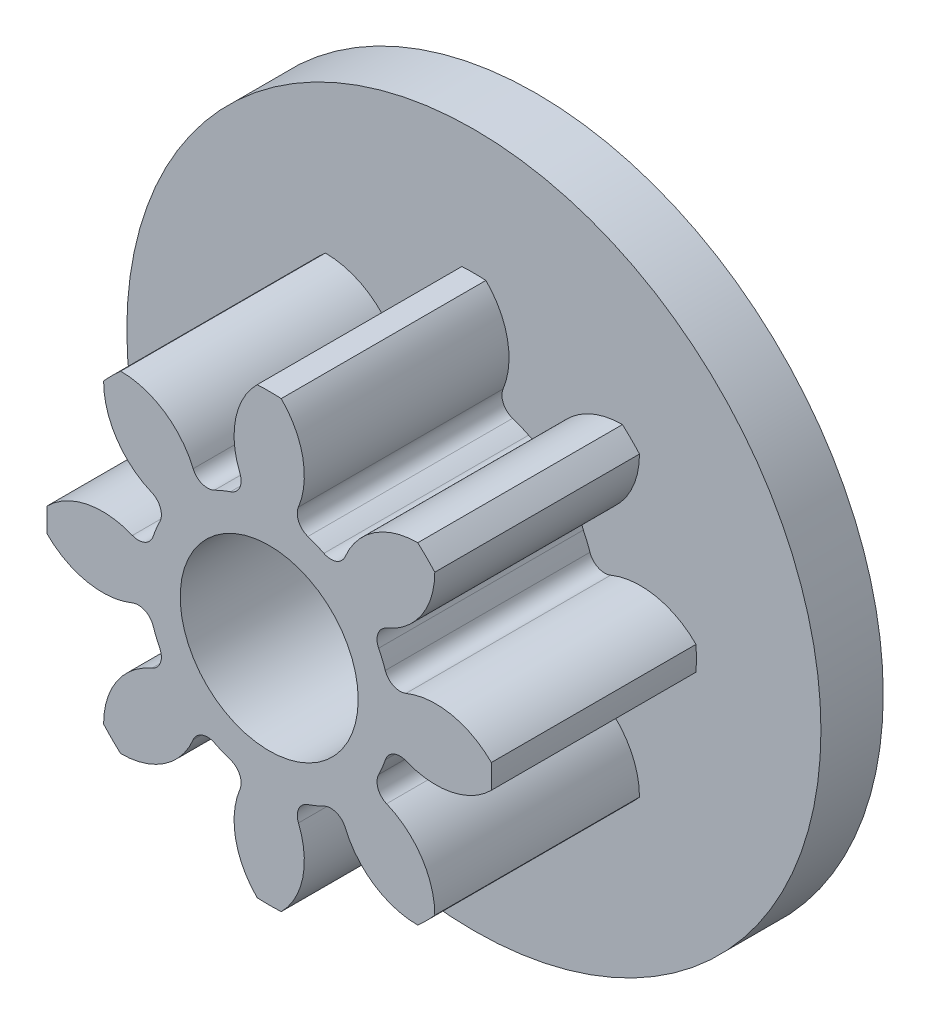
from build123d import *

# Parameters (mm, degrees)
BOSS_EXTRU_1_DEPTH                 = 2.3
CONG_1_R                           = 0.175
R_P_TITION_CIRCULAIRE4_COUNT       = 8
CONG_1_OF_R_P_TITION_CIRCULAIRE4_R = 0.175
ESQUISSE11_R                       = 3.9
EXTRUSION1_DEPTH                   = 0.7
ESQUISSE10_R                       = 1
ENL_V_MAT_EXTRU_4_DEPTH            = 8.533889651


with BuildPart() as part:
    # Esquisse3 → Boss.-Extru.1 (new body)
    with BuildSketch(Plane.XY):
        with BuildLine():
            Line((-1.904896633, 0.709981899), (-1.378706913, -0.560352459))
            Line((-1.378706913, -0.560352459), (-0.852517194, 0.709981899))
            ThreePointArc((-0.852517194, 0.709981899), (-0.999269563, 0.761257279), (-1.150871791, 0.795640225))
            ThreePointArc((-1.150871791, 0.795640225), (-0.986845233, 1.382889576), (-1.243458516, 1.935986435))
            ThreePointArc((-1.243458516, 1.935986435), (-1.378706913, 1.939647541), (-1.51395531, 1.935986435))
            ThreePointArc((-1.51395531, 1.935986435), (-1.770568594, 1.382889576), (-1.606542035, 0.795640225))
            ThreePointArc((-1.606542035, 0.795640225), (-1.758144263, 0.761257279), (-1.904896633, 0.709981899))
        make_face()
    boss_extru_1 = extrude(amount=BOSS_EXTRU_1_DEPTH)

    # Cong_1
    cong_1_edges = [part.edges().sort_by_distance(p)[0] for p in [
        (-1.606542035, 0.795640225, 1.15),
        (-1.150871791, 0.795640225, 1.15),
    ]]
    fillet(cong_1_edges, radius=CONG_1_R)

    # R_p_tition circulaire4: Boss.-Extru.1 ×8 about axis
    r_p_tition_circulaire4_axis = Axis((-1.378706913, -0.560352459, 0), (0, 0, 1))
    for i in range(1, R_P_TITION_CIRCULAIRE4_COUNT):
        add(boss_extru_1.rotate(r_p_tition_circulaire4_axis, i * 360 / R_P_TITION_CIRCULAIRE4_COUNT))

    # Cong_1 of R_p_tition circulaire4
    cong_1_of_r_p_tition_circulaire4_edges = [part.edges().sort_by_distance(p)[0] for p in [
        (-2.498642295, 0.237375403, 1.15),
        (-2.176434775, 0.559582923, 1.15),
        (-2.734699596, -0.788187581, 1.15),
        (-2.734699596, -0.332517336, 1.15),
        (-2.176434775, -1.68028784, 1.15),
        (-2.498642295, -1.35808032, 1.15),
        (-1.150871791, -1.916345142, 1.15),
        (-1.606542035, -1.916345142, 1.15),
        (-0.258771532, -1.35808032, 1.15),
        (-0.580979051, -1.68028784, 1.15),
        (-0.02271423, -0.332517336, 1.15),
        (-0.02271423, -0.788187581, 1.15),
        (-0.580979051, 0.559582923, 1.15),
        (-0.258771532, 0.237375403, 1.15),
    ]]
    fillet(cong_1_of_r_p_tition_circulaire4_edges, radius=CONG_1_OF_R_P_TITION_CIRCULAIRE4_R)

    # Esquisse11 → Extrusion1 (add)
    with BuildSketch(Plane(origin=(0, 0, 0), x_dir=(-1, 0, 0), z_dir=(0, 0, -1))):
        with Locations((1.378706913, -0.560352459)):
            Circle(ESQUISSE11_R)
    extrude(amount=EXTRUSION1_DEPTH)

    # Esquisse10 → Enl_v. mat.-Extru.4 (cut, through all)
    with BuildSketch(Plane.XY.offset(-0.7)):
        with Locations((-1.378706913, -0.560352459)):
            Circle(ESQUISSE10_R)
    extrude(amount=ENL_V_MAT_EXTRU_4_DEPTH, mode=Mode.SUBTRACT)


solid = part.part
